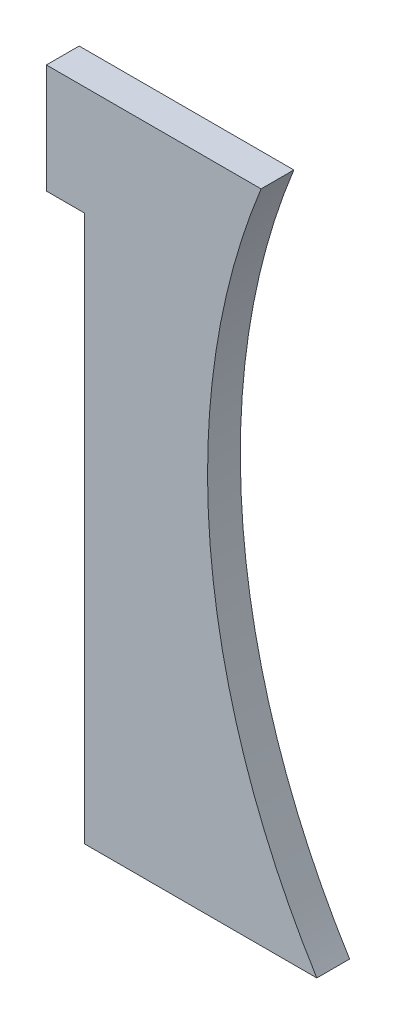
ISO-10303-21;
HEADER;
FILE_DESCRIPTION(('STEP AP214'),'2;1');
FILE_NAME('part.step','',(''),(''),'','','');
FILE_SCHEMA(('AUTOMOTIVE_DESIGN { 1 0 10303 214 1 1 1 1 }'));
ENDSEC;
DATA;
#1=APPLICATION_CONTEXT('core data for automotive mechanical design processes');
#2=APPLICATION_PROTOCOL_DEFINITION('international standard','automotive_design',2000,#1);
#3=PRODUCT_CONTEXT('',#1,'mechanical');
#4=PRODUCT('Part','Part','',(#3));
#5=PRODUCT_RELATED_PRODUCT_CATEGORY('part','',(#4));
#6=PRODUCT_DEFINITION_FORMATION('','',#4);
#7=PRODUCT_DEFINITION_CONTEXT('part definition',#1,'design');
#8=PRODUCT_DEFINITION('design','',#6,#7);
#9=PRODUCT_DEFINITION_SHAPE('','',#8);
#10=(LENGTH_UNIT() NAMED_UNIT(*) SI_UNIT(.MILLI.,.METRE.));
#11=(NAMED_UNIT(*) PLANE_ANGLE_UNIT() SI_UNIT($,.RADIAN.));
#12=(NAMED_UNIT(*) SI_UNIT($,.STERADIAN.) SOLID_ANGLE_UNIT());
#13=UNCERTAINTY_MEASURE_WITH_UNIT(LENGTH_MEASURE(1.E-05),#10,'distance_accuracy_value','');
#14=(GEOMETRIC_REPRESENTATION_CONTEXT(3) GLOBAL_UNCERTAINTY_ASSIGNED_CONTEXT((#13)) GLOBAL_UNIT_ASSIGNED_CONTEXT((#10,
#11,#12)) REPRESENTATION_CONTEXT('',''));
#15=CARTESIAN_POINT('',(0.,0.,0.));
#16=DIRECTION('',(0.,0.,1.));
#17=DIRECTION('',(1.,0.,0.));
#18=AXIS2_PLACEMENT_3D('',#15,#16,#17);
#19=CARTESIAN_POINT('',(0.,0.,12.));
#20=DIRECTION('',(0.,0.,-1.));
#21=DIRECTION('',(-1.,0.,0.));
#22=AXIS2_PLACEMENT_3D('',#19,#20,#21);
#23=CYLINDRICAL_SURFACE('',#22,265.);
#24=CARTESIAN_POINT('',(0.,0.,0.));
#25=DIRECTION('',(0.,0.,-1.));
#26=DIRECTION('',(1.,0.,0.));
#27=AXIS2_PLACEMENT_3D('',#24,#25,#26);
#28=CIRCLE('',#27,265.);
#29=CARTESIAN_POINT('',(-225.,-140.,0.));
#30=VERTEX_POINT('',#29);
#31=CARTESIAN_POINT('',(-245.407823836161,99.9999999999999,0.));
#32=VERTEX_POINT('',#31);
#33=EDGE_CURVE('E86',#30,#32,#28,.T.);
#34=ORIENTED_EDGE('',*,*,#33,.T.);
#35=DIRECTION('',(0.,0.,-1.));
#36=VECTOR('',#35,1.);
#37=CARTESIAN_POINT('',(-245.407823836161,99.9999999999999,12.));
#38=LINE('',#37,#36);
#39=CARTESIAN_POINT('',(-245.407823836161,99.9999999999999,12.));
#40=VERTEX_POINT('',#39);
#41=EDGE_CURVE('E11',#40,#32,#38,.T.);
#42=ORIENTED_EDGE('',*,*,#41,.F.);
#43=CARTESIAN_POINT('',(0.,0.,12.));
#44=DIRECTION('',(0.,0.,-1.));
#45=DIRECTION('',(1.,0.,0.));
#46=AXIS2_PLACEMENT_3D('',#43,#44,#45);
#47=CIRCLE('',#46,265.);
#48=CARTESIAN_POINT('',(-225.,-140.,12.));
#49=VERTEX_POINT('',#48);
#50=EDGE_CURVE('E109',#49,#40,#47,.T.);
#51=ORIENTED_EDGE('',*,*,#50,.F.);
#52=DIRECTION('',(0.,0.,-1.));
#53=VECTOR('',#52,1.);
#54=CARTESIAN_POINT('',(-225.,-140.,12.));
#55=LINE('',#54,#53);
#56=EDGE_CURVE('E99',#49,#30,#55,.T.);
#57=ORIENTED_EDGE('',*,*,#56,.T.);
#58=EDGE_LOOP('',(#34,#42,#51,#57));
#59=FACE_BOUND('',#58,.T.);
#60=ADVANCED_FACE('F30',(#59),#23,.F.);
#61=CARTESIAN_POINT('',(-324.,99.9999999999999,12.));
#62=DIRECTION('',(0.,-1.,0.));
#63=DIRECTION('',(1.,0.,0.));
#64=AXIS2_PLACEMENT_3D('',#61,#62,#63);
#65=PLANE('',#64);
#66=DIRECTION('',(-1.,0.,0.));
#67=VECTOR('',#66,1.);
#68=CARTESIAN_POINT('',(-324.,99.9999999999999,0.));
#69=LINE('',#68,#67);
#70=CARTESIAN_POINT('',(-324.,99.9999999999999,0.));
#71=VERTEX_POINT('',#70);
#72=EDGE_CURVE('E82',#32,#71,#69,.T.);
#73=ORIENTED_EDGE('',*,*,#72,.T.);
#74=DIRECTION('',(0.,0.,-1.));
#75=VECTOR('',#74,1.);
#76=CARTESIAN_POINT('',(-324.,99.9999999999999,12.));
#77=LINE('',#76,#75);
#78=CARTESIAN_POINT('',(-324.,99.9999999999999,12.));
#79=VERTEX_POINT('',#78);
#80=EDGE_CURVE('E37',#79,#71,#77,.T.);
#81=ORIENTED_EDGE('',*,*,#80,.F.);
#82=DIRECTION('',(-1.,0.,0.));
#83=VECTOR('',#82,1.);
#84=CARTESIAN_POINT('',(-324.,99.9999999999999,12.));
#85=LINE('',#84,#83);
#86=EDGE_CURVE('E95',#40,#79,#85,.T.);
#87=ORIENTED_EDGE('',*,*,#86,.F.);
#88=ORIENTED_EDGE('',*,*,#41,.T.);
#89=EDGE_LOOP('',(#73,#81,#87,#88));
#90=FACE_BOUND('',#89,.T.);
#91=ADVANCED_FACE('F94',(#90),#65,.F.);
#92=CARTESIAN_POINT('',(-324.,60.,12.));
#93=DIRECTION('',(1.,0.,0.));
#94=DIRECTION('',(0.,0.,-1.));
#95=AXIS2_PLACEMENT_3D('',#92,#93,#94);
#96=PLANE('',#95);
#97=DIRECTION('',(0.,-1.,0.));
#98=VECTOR('',#97,1.);
#99=CARTESIAN_POINT('',(-324.,60.,0.));
#100=LINE('',#99,#98);
#101=CARTESIAN_POINT('',(-324.,60.,0.));
#102=VERTEX_POINT('',#101);
#103=EDGE_CURVE('E88',#71,#102,#100,.T.);
#104=ORIENTED_EDGE('',*,*,#103,.T.);
#105=DIRECTION('',(0.,0.,-1.));
#106=VECTOR('',#105,1.);
#107=CARTESIAN_POINT('',(-324.,60.,12.));
#108=LINE('',#107,#106);
#109=CARTESIAN_POINT('',(-324.,60.,12.));
#110=VERTEX_POINT('',#109);
#111=EDGE_CURVE('E125',#110,#102,#108,.T.);
#112=ORIENTED_EDGE('',*,*,#111,.F.);
#113=DIRECTION('',(0.,-1.,0.));
#114=VECTOR('',#113,1.);
#115=CARTESIAN_POINT('',(-324.,60.,12.));
#116=LINE('',#115,#114);
#117=EDGE_CURVE('E112',#79,#110,#116,.T.);
#118=ORIENTED_EDGE('',*,*,#117,.F.);
#119=ORIENTED_EDGE('',*,*,#80,.T.);
#120=EDGE_LOOP('',(#104,#112,#118,#119));
#121=FACE_BOUND('',#120,.T.);
#122=ADVANCED_FACE('F129',(#121),#96,.F.);
#123=CARTESIAN_POINT('',(-310.,60.,12.));
#124=DIRECTION('',(0.,1.,0.));
#125=DIRECTION('',(-1.,0.,0.));
#126=AXIS2_PLACEMENT_3D('',#123,#124,#125);
#127=PLANE('',#126);
#128=DIRECTION('',(1.,0.,0.));
#129=VECTOR('',#128,1.);
#130=CARTESIAN_POINT('',(-310.,60.,0.));
#131=LINE('',#130,#129);
#132=CARTESIAN_POINT('',(-310.,60.,0.));
#133=VERTEX_POINT('',#132);
#134=EDGE_CURVE('E103',#102,#133,#131,.T.);
#135=ORIENTED_EDGE('',*,*,#134,.T.);
#136=DIRECTION('',(0.,0.,-1.));
#137=VECTOR('',#136,1.);
#138=CARTESIAN_POINT('',(-310.,60.,12.));
#139=LINE('',#138,#137);
#140=CARTESIAN_POINT('',(-310.,60.,12.));
#141=VERTEX_POINT('',#140);
#142=EDGE_CURVE('E122',#141,#133,#139,.T.);
#143=ORIENTED_EDGE('',*,*,#142,.F.);
#144=DIRECTION('',(1.,0.,0.));
#145=VECTOR('',#144,1.);
#146=CARTESIAN_POINT('',(-310.,60.,12.));
#147=LINE('',#146,#145);
#148=EDGE_CURVE('E114',#110,#141,#147,.T.);
#149=ORIENTED_EDGE('',*,*,#148,.F.);
#150=ORIENTED_EDGE('',*,*,#111,.T.);
#151=EDGE_LOOP('',(#135,#143,#149,#150));
#152=FACE_BOUND('',#151,.T.);
#153=ADVANCED_FACE('F135',(#152),#127,.F.);
#154=CARTESIAN_POINT('',(-310.,-140.,12.));
#155=DIRECTION('',(1.,0.,0.));
#156=DIRECTION('',(0.,0.,-1.));
#157=AXIS2_PLACEMENT_3D('',#154,#155,#156);
#158=PLANE('',#157);
#159=DIRECTION('',(0.,-1.,0.));
#160=VECTOR('',#159,1.);
#161=CARTESIAN_POINT('',(-310.,-140.,0.));
#162=LINE('',#161,#160);
#163=CARTESIAN_POINT('',(-310.,-140.,0.));
#164=VERTEX_POINT('',#163);
#165=EDGE_CURVE('E105',#133,#164,#162,.T.);
#166=ORIENTED_EDGE('',*,*,#165,.T.);
#167=DIRECTION('',(0.,0.,-1.));
#168=VECTOR('',#167,1.);
#169=CARTESIAN_POINT('',(-310.,-140.,12.));
#170=LINE('',#169,#168);
#171=CARTESIAN_POINT('',(-310.,-140.,12.));
#172=VERTEX_POINT('',#171);
#173=EDGE_CURVE('E119',#172,#164,#170,.T.);
#174=ORIENTED_EDGE('',*,*,#173,.F.);
#175=DIRECTION('',(0.,-1.,0.));
#176=VECTOR('',#175,1.);
#177=CARTESIAN_POINT('',(-310.,-140.,12.));
#178=LINE('',#177,#176);
#179=EDGE_CURVE('E49',#141,#172,#178,.T.);
#180=ORIENTED_EDGE('',*,*,#179,.F.);
#181=ORIENTED_EDGE('',*,*,#142,.T.);
#182=EDGE_LOOP('',(#166,#174,#180,#181));
#183=FACE_BOUND('',#182,.T.);
#184=ADVANCED_FACE('F138',(#183),#158,.F.);
#185=CARTESIAN_POINT('',(-225.,-140.,12.));
#186=DIRECTION('',(0.,1.,0.));
#187=DIRECTION('',(-1.,0.,0.));
#188=AXIS2_PLACEMENT_3D('',#185,#186,#187);
#189=PLANE('',#188);
#190=DIRECTION('',(1.,0.,0.));
#191=VECTOR('',#190,1.);
#192=CARTESIAN_POINT('',(-225.,-140.,0.));
#193=LINE('',#192,#191);
#194=EDGE_CURVE('E107',#164,#30,#193,.T.);
#195=ORIENTED_EDGE('',*,*,#194,.T.);
#196=ORIENTED_EDGE('',*,*,#56,.F.);
#197=DIRECTION('',(1.,0.,0.));
#198=VECTOR('',#197,1.);
#199=CARTESIAN_POINT('',(-225.,-140.,12.));
#200=LINE('',#199,#198);
#201=EDGE_CURVE('E44',#172,#49,#200,.T.);
#202=ORIENTED_EDGE('',*,*,#201,.F.);
#203=ORIENTED_EDGE('',*,*,#173,.T.);
#204=EDGE_LOOP('',(#195,#196,#202,#203));
#205=FACE_BOUND('',#204,.T.);
#206=ADVANCED_FACE('F140',(#205),#189,.F.);
#207=CARTESIAN_POINT('',(0.,0.,12.));
#208=DIRECTION('',(0.,0.,1.));
#209=DIRECTION('',(1.,0.,0.));
#210=AXIS2_PLACEMENT_3D('',#207,#208,#209);
#211=PLANE('',#210);
#212=ORIENTED_EDGE('',*,*,#50,.T.);
#213=ORIENTED_EDGE('',*,*,#86,.T.);
#214=ORIENTED_EDGE('',*,*,#117,.T.);
#215=ORIENTED_EDGE('',*,*,#148,.T.);
#216=ORIENTED_EDGE('',*,*,#179,.T.);
#217=ORIENTED_EDGE('',*,*,#201,.T.);
#218=EDGE_LOOP('',(#212,#213,#214,#215,#216,#217));
#219=FACE_BOUND('',#218,.T.);
#220=ADVANCED_FACE('F132',(#219),#211,.T.);
#221=CARTESIAN_POINT('',(0.,0.,0.));
#222=DIRECTION('',(0.,0.,1.));
#223=DIRECTION('',(1.,0.,0.));
#224=AXIS2_PLACEMENT_3D('',#221,#222,#223);
#225=PLANE('',#224);
#226=ORIENTED_EDGE('',*,*,#33,.F.);
#227=ORIENTED_EDGE('',*,*,#194,.F.);
#228=ORIENTED_EDGE('',*,*,#165,.F.);
#229=ORIENTED_EDGE('',*,*,#134,.F.);
#230=ORIENTED_EDGE('',*,*,#103,.F.);
#231=ORIENTED_EDGE('',*,*,#72,.F.);
#232=EDGE_LOOP('',(#226,#227,#228,#229,#230,#231));
#233=FACE_BOUND('',#232,.T.);
#234=ADVANCED_FACE('F83',(#233),#225,.F.);
#235=CLOSED_SHELL('',(#60,#91,#122,#153,#184,#206,#220,#234));
#236=MANIFOLD_SOLID_BREP('B2',#235);
#237=ADVANCED_BREP_SHAPE_REPRESENTATION('',(#18,#236),#14);
#238=SHAPE_DEFINITION_REPRESENTATION(#9,#237);
ENDSEC;
END-ISO-10303-21;
